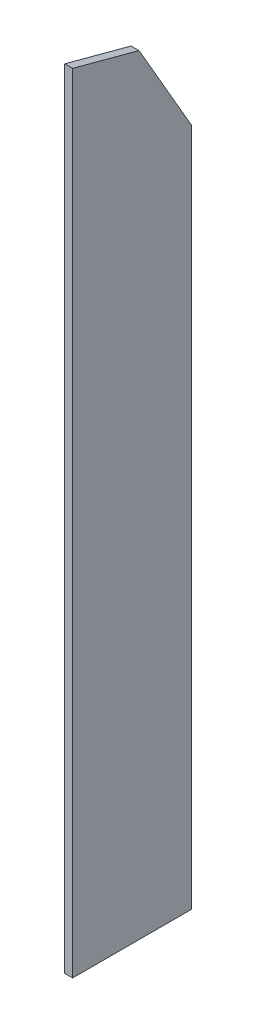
ISO-10303-21;
HEADER;
FILE_DESCRIPTION(('STEP AP214'),'2;1');
FILE_NAME('part.step','',(''),(''),'','','');
FILE_SCHEMA(('AUTOMOTIVE_DESIGN { 1 0 10303 214 1 1 1 1 }'));
ENDSEC;
DATA;
#1=APPLICATION_CONTEXT('core data for automotive mechanical design processes');
#2=APPLICATION_PROTOCOL_DEFINITION('international standard','automotive_design',2000,#1);
#3=PRODUCT_CONTEXT('',#1,'mechanical');
#4=PRODUCT('Part','Part','',(#3));
#5=PRODUCT_RELATED_PRODUCT_CATEGORY('part','',(#4));
#6=PRODUCT_DEFINITION_FORMATION('','',#4);
#7=PRODUCT_DEFINITION_CONTEXT('part definition',#1,'design');
#8=PRODUCT_DEFINITION('design','',#6,#7);
#9=PRODUCT_DEFINITION_SHAPE('','',#8);
#10=(LENGTH_UNIT() NAMED_UNIT(*) SI_UNIT(.MILLI.,.METRE.));
#11=(NAMED_UNIT(*) PLANE_ANGLE_UNIT() SI_UNIT($,.RADIAN.));
#12=(NAMED_UNIT(*) SI_UNIT($,.STERADIAN.) SOLID_ANGLE_UNIT());
#13=UNCERTAINTY_MEASURE_WITH_UNIT(LENGTH_MEASURE(1.E-05),#10,'distance_accuracy_value','');
#14=(GEOMETRIC_REPRESENTATION_CONTEXT(3) GLOBAL_UNCERTAINTY_ASSIGNED_CONTEXT((#13)) GLOBAL_UNIT_ASSIGNED_CONTEXT((#10,
#11,#12)) REPRESENTATION_CONTEXT('',''));
#15=CARTESIAN_POINT('',(0.,0.,0.));
#16=DIRECTION('',(0.,0.,1.));
#17=DIRECTION('',(1.,0.,0.));
#18=AXIS2_PLACEMENT_3D('',#15,#16,#17);
#19=CARTESIAN_POINT('',(25.4,5101.6125,380.999999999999));
#20=DIRECTION('',(-1.,0.,0.));
#21=DIRECTION('',(0.,0.,1.));
#22=AXIS2_PLACEMENT_3D('',#19,#20,#21);
#23=PLANE('',#22);
#24=DIRECTION('',(0.,-0.258819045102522,-0.965925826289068));
#25=VECTOR('',#24,1.);
#26=CARTESIAN_POINT('',(25.4,4959.30710999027,-45.4859399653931));
#27=LINE('',#26,#25);
#28=CARTESIAN_POINT('',(25.4,5073.58367318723,380.999999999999));
#29=VERTEX_POINT('',#28);
#30=CARTESIAN_POINT('',(25.4,4959.30710999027,-45.4859399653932));
#31=VERTEX_POINT('',#30);
#32=EDGE_CURVE('E60',#29,#31,#27,.T.);
#33=ORIENTED_EDGE('',*,*,#32,.F.);
#34=DIRECTION('',(0.,-1.,0.));
#35=VECTOR('',#34,1.);
#36=CARTESIAN_POINT('',(25.4,5101.6125,380.999999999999));
#37=LINE('',#36,#35);
#38=CARTESIAN_POINT('',(25.4,19.9999999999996,380.999999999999));
#39=VERTEX_POINT('',#38);
#40=EDGE_CURVE('E157',#29,#39,#37,.T.);
#41=ORIENTED_EDGE('',*,*,#40,.T.);
#42=DIRECTION('',(0.,0.,-1.));
#43=VECTOR('',#42,1.);
#44=CARTESIAN_POINT('',(25.4,19.9999999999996,380.999999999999));
#45=LINE('',#44,#43);
#46=CARTESIAN_POINT('',(25.3999999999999,19.9999999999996,-381.000000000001));
#47=VERTEX_POINT('',#46);
#48=EDGE_CURVE('E185',#39,#47,#45,.T.);
#49=ORIENTED_EDGE('',*,*,#48,.T.);
#50=DIRECTION('',(0.,-1.,0.));
#51=VECTOR('',#50,1.);
#52=CARTESIAN_POINT('',(25.3999999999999,5101.6125,-381.000000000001));
#53=LINE('',#52,#51);
#54=CARTESIAN_POINT('',(25.4,4380.42971135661,-381.000000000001));
#55=VERTEX_POINT('',#54);
#56=EDGE_CURVE('E134',#55,#47,#53,.T.);
#57=ORIENTED_EDGE('',*,*,#56,.F.);
#58=DIRECTION('',(0.,0.,-1.));
#59=VECTOR('',#58,1.);
#60=CARTESIAN_POINT('',(25.4,4380.42971135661,-379.700961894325));
#61=LINE('',#60,#59);
#62=CARTESIAN_POINT('',(25.4,4380.42971135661,-379.700961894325));
#63=VERTEX_POINT('',#62);
#64=EDGE_CURVE('E117',#63,#55,#61,.T.);
#65=ORIENTED_EDGE('',*,*,#64,.F.);
#66=DIRECTION('',(0.,-0.86602540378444,-0.499999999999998));
#67=VECTOR('',#66,1.);
#68=CARTESIAN_POINT('',(25.4,4380.42971135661,-379.700961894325));
#69=LINE('',#68,#67);
#70=EDGE_CURVE('E130',#31,#63,#69,.T.);
#71=ORIENTED_EDGE('',*,*,#70,.F.);
#72=EDGE_LOOP('',(#33,#41,#49,#57,#65,#71));
#73=FACE_BOUND('',#72,.T.);
#74=ADVANCED_FACE('F50',(#73),#23,.F.);
#75=CARTESIAN_POINT('',(-25.3999999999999,5101.6125,380.999999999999));
#76=DIRECTION('',(1.,0.,0.));
#77=DIRECTION('',(0.,0.,-1.));
#78=AXIS2_PLACEMENT_3D('',#75,#76,#77);
#79=PLANE('',#78);
#80=DIRECTION('',(0.,-1.,0.));
#81=VECTOR('',#80,1.);
#82=CARTESIAN_POINT('',(-25.3999999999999,5101.6125,380.999999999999));
#83=LINE('',#82,#81);
#84=CARTESIAN_POINT('',(-25.4000000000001,5073.58367318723,380.999999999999));
#85=VERTEX_POINT('',#84);
#86=CARTESIAN_POINT('',(-25.3999999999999,19.9999999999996,380.999999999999));
#87=VERTEX_POINT('',#86);
#88=EDGE_CURVE('E165',#85,#87,#83,.T.);
#89=ORIENTED_EDGE('',*,*,#88,.F.);
#90=DIRECTION('',(0.,-0.258819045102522,-0.965925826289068));
#91=VECTOR('',#90,1.);
#92=CARTESIAN_POINT('',(-25.4000000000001,4959.30710999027,-45.4859399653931));
#93=LINE('',#92,#91);
#94=CARTESIAN_POINT('',(-25.4000000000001,4959.30710999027,-45.4859399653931));
#95=VERTEX_POINT('',#94);
#96=EDGE_CURVE('E140',#85,#95,#93,.T.);
#97=ORIENTED_EDGE('',*,*,#96,.T.);
#98=DIRECTION('',(0.,-0.86602540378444,-0.499999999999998));
#99=VECTOR('',#98,1.);
#100=CARTESIAN_POINT('',(-25.4000000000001,4380.42971135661,-379.700961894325));
#101=LINE('',#100,#99);
#102=CARTESIAN_POINT('',(-25.4000000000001,4380.42971135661,-379.700961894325));
#103=VERTEX_POINT('',#102);
#104=EDGE_CURVE('E143',#95,#103,#101,.T.);
#105=ORIENTED_EDGE('',*,*,#104,.T.);
#106=DIRECTION('',(0.,0.,-1.));
#107=VECTOR('',#106,1.);
#108=CARTESIAN_POINT('',(-25.4000000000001,4380.42971135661,-379.700961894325));
#109=LINE('',#108,#107);
#110=CARTESIAN_POINT('',(-25.4000000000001,4380.42971135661,-381.000000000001));
#111=VERTEX_POINT('',#110);
#112=EDGE_CURVE('E121',#103,#111,#109,.T.);
#113=ORIENTED_EDGE('',*,*,#112,.T.);
#114=DIRECTION('',(0.,-1.,0.));
#115=VECTOR('',#114,1.);
#116=CARTESIAN_POINT('',(-25.4000000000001,5101.6125,-381.000000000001));
#117=LINE('',#116,#115);
#118=CARTESIAN_POINT('',(-25.4000000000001,19.9999999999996,-381.000000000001));
#119=VERTEX_POINT('',#118);
#120=EDGE_CURVE('E75',#111,#119,#117,.T.);
#121=ORIENTED_EDGE('',*,*,#120,.T.);
#122=DIRECTION('',(0.,0.,1.));
#123=VECTOR('',#122,1.);
#124=CARTESIAN_POINT('',(-25.3999999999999,19.9999999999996,380.999999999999));
#125=LINE('',#124,#123);
#126=EDGE_CURVE('E186',#119,#87,#125,.T.);
#127=ORIENTED_EDGE('',*,*,#126,.T.);
#128=EDGE_LOOP('',(#89,#97,#105,#113,#121,#127));
#129=FACE_BOUND('',#128,.T.);
#130=ADVANCED_FACE('F230',(#129),#79,.F.);
#131=CARTESIAN_POINT('',(25.4,5101.6125,380.999999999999));
#132=DIRECTION('',(0.,0.,-1.));
#133=DIRECTION('',(-1.,0.,0.));
#134=AXIS2_PLACEMENT_3D('',#131,#132,#133);
#135=PLANE('',#134);
#136=ORIENTED_EDGE('',*,*,#40,.F.);
#137=DIRECTION('',(-1.,0.,0.));
#138=VECTOR('',#137,1.);
#139=CARTESIAN_POINT('',(25.4,5073.58367318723,380.999999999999));
#140=LINE('',#139,#138);
#141=EDGE_CURVE('E11',#29,#85,#140,.T.);
#142=ORIENTED_EDGE('',*,*,#141,.T.);
#143=ORIENTED_EDGE('',*,*,#88,.T.);
#144=DIRECTION('',(1.,0.,0.));
#145=VECTOR('',#144,1.);
#146=CARTESIAN_POINT('',(25.4,19.9999999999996,380.999999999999));
#147=LINE('',#146,#145);
#148=EDGE_CURVE('E164',#87,#39,#147,.T.);
#149=ORIENTED_EDGE('',*,*,#148,.T.);
#150=EDGE_LOOP('',(#136,#142,#143,#149));
#151=FACE_BOUND('',#150,.T.);
#152=ADVANCED_FACE('F223',(#151),#135,.F.);
#153=CARTESIAN_POINT('',(25.3999999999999,5101.6125,-381.000000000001));
#154=DIRECTION('',(0.,0.,1.));
#155=DIRECTION('',(1.,0.,0.));
#156=AXIS2_PLACEMENT_3D('',#153,#154,#155);
#157=PLANE('',#156);
#158=ORIENTED_EDGE('',*,*,#120,.F.);
#159=DIRECTION('',(1.,0.,0.));
#160=VECTOR('',#159,1.);
#161=CARTESIAN_POINT('',(-25.4000000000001,4380.42971135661,-381.000000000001));
#162=LINE('',#161,#160);
#163=EDGE_CURVE('E123',#111,#55,#162,.T.);
#164=ORIENTED_EDGE('',*,*,#163,.T.);
#165=ORIENTED_EDGE('',*,*,#56,.T.);
#166=DIRECTION('',(-1.,0.,0.));
#167=VECTOR('',#166,1.);
#168=CARTESIAN_POINT('',(25.3999999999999,19.9999999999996,-381.000000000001));
#169=LINE('',#168,#167);
#170=EDGE_CURVE('E183',#47,#119,#169,.T.);
#171=ORIENTED_EDGE('',*,*,#170,.T.);
#172=EDGE_LOOP('',(#158,#164,#165,#171));
#173=FACE_BOUND('',#172,.T.);
#174=ADVANCED_FACE('F233',(#173),#157,.F.);
#175=CARTESIAN_POINT('',(0.,0.,0.));
#176=DIRECTION('',(0.,1.,0.));
#177=DIRECTION('',(0.,0.,1.));
#178=AXIS2_PLACEMENT_3D('',#175,#176,#177);
#179=PLANE('',#178);
#180=DIRECTION('',(0.,0.,1.));
#181=VECTOR('',#180,1.);
#182=CARTESIAN_POINT('',(5.39999999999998,0.,0.));
#183=LINE('',#182,#181);
#184=CARTESIAN_POINT('',(5.39999999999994,0.,-361.000000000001));
#185=VERTEX_POINT('',#184);
#186=CARTESIAN_POINT('',(5.40000000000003,0.,360.999999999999));
#187=VERTEX_POINT('',#186);
#188=EDGE_CURVE('E174',#185,#187,#183,.T.);
#189=ORIENTED_EDGE('',*,*,#188,.T.);
#190=DIRECTION('',(-1.,0.,0.));
#191=VECTOR('',#190,1.);
#192=CARTESIAN_POINT('',(0.,0.,360.999999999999));
#193=LINE('',#192,#191);
#194=CARTESIAN_POINT('',(-5.39999999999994,0.,360.999999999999));
#195=VERTEX_POINT('',#194);
#196=EDGE_CURVE('E177',#187,#195,#193,.T.);
#197=ORIENTED_EDGE('',*,*,#196,.T.);
#198=DIRECTION('',(0.,0.,-1.));
#199=VECTOR('',#198,1.);
#200=CARTESIAN_POINT('',(-5.39999999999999,0.,0.));
#201=LINE('',#200,#199);
#202=CARTESIAN_POINT('',(-5.40000000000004,0.,-361.000000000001));
#203=VERTEX_POINT('',#202);
#204=EDGE_CURVE('E166',#195,#203,#201,.T.);
#205=ORIENTED_EDGE('',*,*,#204,.T.);
#206=DIRECTION('',(1.,0.,0.));
#207=VECTOR('',#206,1.);
#208=CARTESIAN_POINT('',(0.,0.,-361.000000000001));
#209=LINE('',#208,#207);
#210=EDGE_CURVE('E175',#203,#185,#209,.T.);
#211=ORIENTED_EDGE('',*,*,#210,.T.);
#212=EDGE_LOOP('',(#189,#197,#205,#211));
#213=FACE_BOUND('',#212,.T.);
#214=ADVANCED_FACE('F212',(#213),#179,.F.);
#215=CARTESIAN_POINT('',(25.3999999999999,19.9999999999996,-381.000000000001));
#216=DIRECTION('',(0.,0.707106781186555,0.70710678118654));
#217=DIRECTION('',(-1.,0.,0.));
#218=AXIS2_PLACEMENT_3D('',#215,#216,#217);
#219=PLANE('',#218);
#220=DIRECTION('',(-0.57735026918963,-0.577350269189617,0.57735026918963));
#221=VECTOR('',#220,1.);
#222=CARTESIAN_POINT('',(25.3999999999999,19.9999999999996,-381.000000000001));
#223=LINE('',#222,#221);
#224=EDGE_CURVE('E197',#185,#47,#223,.F.);
#225=ORIENTED_EDGE('',*,*,#224,.F.);
#226=ORIENTED_EDGE('',*,*,#210,.F.);
#227=DIRECTION('',(0.57735026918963,-0.577350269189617,0.57735026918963));
#228=VECTOR('',#227,1.);
#229=CARTESIAN_POINT('',(228.600000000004,-233.999999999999,-126.999999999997));
#230=LINE('',#229,#228);
#231=EDGE_CURVE('E156',#119,#203,#230,.T.);
#232=ORIENTED_EDGE('',*,*,#231,.F.);
#233=ORIENTED_EDGE('',*,*,#170,.F.);
#234=EDGE_LOOP('',(#225,#226,#232,#233));
#235=FACE_BOUND('',#234,.T.);
#236=ADVANCED_FACE('F49',(#235),#219,.F.);
#237=CARTESIAN_POINT('',(-25.3999999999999,19.9999999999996,380.999999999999));
#238=DIRECTION('',(0.70710678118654,0.707106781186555,0.));
#239=DIRECTION('',(0.,0.,1.));
#240=AXIS2_PLACEMENT_3D('',#237,#238,#239);
#241=PLANE('',#240);
#242=ORIENTED_EDGE('',*,*,#231,.T.);
#243=ORIENTED_EDGE('',*,*,#204,.F.);
#244=DIRECTION('',(-0.57735026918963,0.577350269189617,0.57735026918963));
#245=VECTOR('',#244,1.);
#246=CARTESIAN_POINT('',(-25.3999999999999,19.9999999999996,380.999999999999));
#247=LINE('',#246,#245);
#248=EDGE_CURVE('E193',#87,#195,#247,.F.);
#249=ORIENTED_EDGE('',*,*,#248,.F.);
#250=ORIENTED_EDGE('',*,*,#126,.F.);
#251=EDGE_LOOP('',(#242,#243,#249,#250));
#252=FACE_BOUND('',#251,.T.);
#253=ADVANCED_FACE('F206',(#252),#241,.F.);
#254=CARTESIAN_POINT('',(25.4,19.9999999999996,380.999999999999));
#255=DIRECTION('',(-0.70710678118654,0.707106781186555,0.));
#256=DIRECTION('',(0.,0.,-1.));
#257=AXIS2_PLACEMENT_3D('',#254,#255,#256);
#258=PLANE('',#257);
#259=ORIENTED_EDGE('',*,*,#224,.T.);
#260=ORIENTED_EDGE('',*,*,#48,.F.);
#261=DIRECTION('',(-0.57735026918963,-0.577350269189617,-0.57735026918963));
#262=VECTOR('',#261,1.);
#263=CARTESIAN_POINT('',(25.4,19.9999999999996,380.999999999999));
#264=LINE('',#263,#262);
#265=EDGE_CURVE('E147',#187,#39,#264,.F.);
#266=ORIENTED_EDGE('',*,*,#265,.F.);
#267=ORIENTED_EDGE('',*,*,#188,.F.);
#268=EDGE_LOOP('',(#259,#260,#266,#267));
#269=FACE_BOUND('',#268,.T.);
#270=ADVANCED_FACE('F225',(#269),#258,.F.);
#271=CARTESIAN_POINT('',(25.4,19.9999999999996,380.999999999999));
#272=DIRECTION('',(0.,0.707106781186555,-0.70710678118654));
#273=DIRECTION('',(1.,0.,0.));
#274=AXIS2_PLACEMENT_3D('',#271,#272,#273);
#275=PLANE('',#274);
#276=ORIENTED_EDGE('',*,*,#248,.T.);
#277=ORIENTED_EDGE('',*,*,#196,.F.);
#278=ORIENTED_EDGE('',*,*,#265,.T.);
#279=ORIENTED_EDGE('',*,*,#148,.F.);
#280=EDGE_LOOP('',(#276,#277,#278,#279));
#281=FACE_BOUND('',#280,.T.);
#282=ADVANCED_FACE('F217',(#281),#275,.F.);
#283=CARTESIAN_POINT('',(-25.4000000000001,4959.30710999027,-45.4859399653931));
#284=DIRECTION('',(0.,-0.965925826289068,0.258819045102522));
#285=DIRECTION('',(0.,-0.258819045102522,-0.965925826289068));
#286=AXIS2_PLACEMENT_3D('',#283,#284,#285);
#287=PLANE('',#286);
#288=ORIENTED_EDGE('',*,*,#32,.T.);
#289=DIRECTION('',(1.,0.,0.));
#290=VECTOR('',#289,1.);
#291=CARTESIAN_POINT('',(-25.4000000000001,4959.30710999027,-45.4859399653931));
#292=LINE('',#291,#290);
#293=EDGE_CURVE('E62',#95,#31,#292,.T.);
#294=ORIENTED_EDGE('',*,*,#293,.F.);
#295=ORIENTED_EDGE('',*,*,#96,.F.);
#296=ORIENTED_EDGE('',*,*,#141,.F.);
#297=EDGE_LOOP('',(#288,#294,#295,#296));
#298=FACE_BOUND('',#297,.T.);
#299=ADVANCED_FACE('F242',(#298),#287,.F.);
#300=CARTESIAN_POINT('',(-25.4000000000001,4380.42971135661,-379.700961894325));
#301=DIRECTION('',(0.,-1.,0.));
#302=DIRECTION('',(0.,0.,-1.));
#303=AXIS2_PLACEMENT_3D('',#300,#301,#302);
#304=PLANE('',#303);
#305=ORIENTED_EDGE('',*,*,#163,.F.);
#306=ORIENTED_EDGE('',*,*,#112,.F.);
#307=DIRECTION('',(1.,0.,0.));
#308=VECTOR('',#307,1.);
#309=CARTESIAN_POINT('',(-25.4000000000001,4380.42971135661,-379.700961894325));
#310=LINE('',#309,#308);
#311=EDGE_CURVE('E118',#103,#63,#310,.T.);
#312=ORIENTED_EDGE('',*,*,#311,.T.);
#313=ORIENTED_EDGE('',*,*,#64,.T.);
#314=EDGE_LOOP('',(#305,#306,#312,#313));
#315=FACE_BOUND('',#314,.T.);
#316=ADVANCED_FACE('F120',(#315),#304,.F.);
#317=CARTESIAN_POINT('',(-25.4000000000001,4380.42971135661,-379.700961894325));
#318=DIRECTION('',(0.,-0.499999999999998,0.86602540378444));
#319=DIRECTION('',(0.,-0.86602540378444,-0.499999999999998));
#320=AXIS2_PLACEMENT_3D('',#317,#318,#319);
#321=PLANE('',#320);
#322=ORIENTED_EDGE('',*,*,#311,.F.);
#323=ORIENTED_EDGE('',*,*,#104,.F.);
#324=ORIENTED_EDGE('',*,*,#293,.T.);
#325=ORIENTED_EDGE('',*,*,#70,.T.);
#326=EDGE_LOOP('',(#322,#323,#324,#325));
#327=FACE_BOUND('',#326,.T.);
#328=ADVANCED_FACE('F126',(#327),#321,.F.);
#329=CLOSED_SHELL('',(#74,#130,#152,#174,#214,#236,#253,#270,#282,#299,#316,#328));
#330=MANIFOLD_SOLID_BREP('B2',#329);
#331=ADVANCED_BREP_SHAPE_REPRESENTATION('',(#18,#330),#14);
#332=SHAPE_DEFINITION_REPRESENTATION(#9,#331);
ENDSEC;
END-ISO-10303-21;
